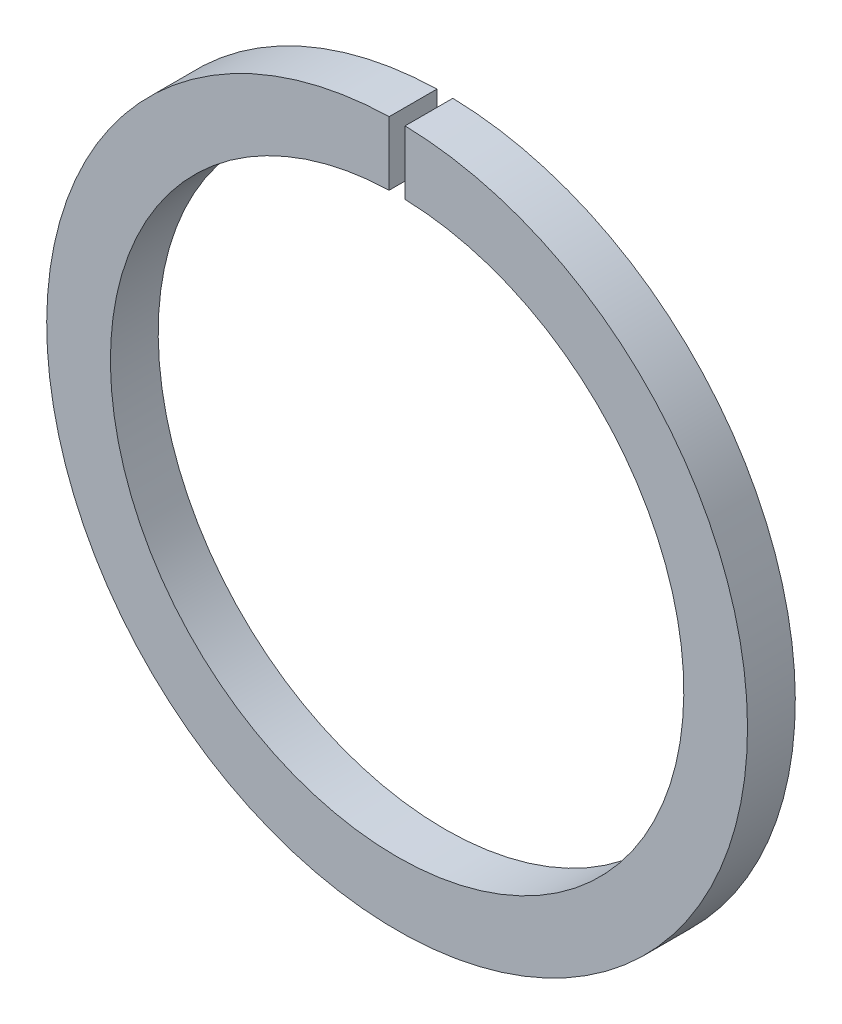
ISO-10303-21;
HEADER;
FILE_DESCRIPTION(('STEP AP214'),'2;1');
FILE_NAME('part.step','',(''),(''),'','','');
FILE_SCHEMA(('AUTOMOTIVE_DESIGN { 1 0 10303 214 1 1 1 1 }'));
ENDSEC;
DATA;
#1=APPLICATION_CONTEXT('core data for automotive mechanical design processes');
#2=APPLICATION_PROTOCOL_DEFINITION('international standard','automotive_design',2000,#1);
#3=PRODUCT_CONTEXT('',#1,'mechanical');
#4=PRODUCT('Part','Part','',(#3));
#5=PRODUCT_RELATED_PRODUCT_CATEGORY('part','',(#4));
#6=PRODUCT_DEFINITION_FORMATION('','',#4);
#7=PRODUCT_DEFINITION_CONTEXT('part definition',#1,'design');
#8=PRODUCT_DEFINITION('design','',#6,#7);
#9=PRODUCT_DEFINITION_SHAPE('','',#8);
#10=(LENGTH_UNIT() NAMED_UNIT(*) SI_UNIT(.MILLI.,.METRE.));
#11=(NAMED_UNIT(*) PLANE_ANGLE_UNIT() SI_UNIT($,.RADIAN.));
#12=(NAMED_UNIT(*) SI_UNIT($,.STERADIAN.) SOLID_ANGLE_UNIT());
#13=UNCERTAINTY_MEASURE_WITH_UNIT(LENGTH_MEASURE(1.E-05),#10,'distance_accuracy_value','');
#14=(GEOMETRIC_REPRESENTATION_CONTEXT(3) GLOBAL_UNCERTAINTY_ASSIGNED_CONTEXT((#13)) GLOBAL_UNIT_ASSIGNED_CONTEXT((#10,
#11,#12)) REPRESENTATION_CONTEXT('',''));
#15=CARTESIAN_POINT('',(0.,0.,0.));
#16=DIRECTION('',(0.,0.,1.));
#17=DIRECTION('',(1.,0.,0.));
#18=AXIS2_PLACEMENT_3D('',#15,#16,#17);
#19=CARTESIAN_POINT('',(0.,0.,1.5));
#20=DIRECTION('',(0.,0.,-1.));
#21=DIRECTION('',(-1.,0.,0.));
#22=AXIS2_PLACEMENT_3D('',#19,#20,#21);
#23=CYLINDRICAL_SURFACE('',#22,11.);
#24=CARTESIAN_POINT('',(0.,0.,0.));
#25=DIRECTION('',(0.,0.,1.));
#26=DIRECTION('',(1.,0.,0.));
#27=AXIS2_PLACEMENT_3D('',#24,#25,#26);
#28=CIRCLE('',#27,11.);
#29=CARTESIAN_POINT('',(-0.25,10.9971587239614,0.));
#30=VERTEX_POINT('',#29);
#31=CARTESIAN_POINT('',(0.25,10.9971587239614,0.));
#32=VERTEX_POINT('',#31);
#33=EDGE_CURVE('E76',#30,#32,#28,.T.);
#34=ORIENTED_EDGE('',*,*,#33,.T.);
#35=DIRECTION('',(0.,0.,-1.));
#36=VECTOR('',#35,1.);
#37=CARTESIAN_POINT('',(0.25,10.9971587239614,1.5));
#38=LINE('',#37,#36);
#39=CARTESIAN_POINT('',(0.25,10.9971587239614,1.5));
#40=VERTEX_POINT('',#39);
#41=EDGE_CURVE('E11',#40,#32,#38,.T.);
#42=ORIENTED_EDGE('',*,*,#41,.F.);
#43=CARTESIAN_POINT('',(0.,0.,1.5));
#44=DIRECTION('',(0.,0.,1.));
#45=DIRECTION('',(1.,0.,0.));
#46=AXIS2_PLACEMENT_3D('',#43,#44,#45);
#47=CIRCLE('',#46,11.);
#48=CARTESIAN_POINT('',(-0.25,10.9971587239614,1.5));
#49=VERTEX_POINT('',#48);
#50=EDGE_CURVE('E94',#49,#40,#47,.T.);
#51=ORIENTED_EDGE('',*,*,#50,.F.);
#52=DIRECTION('',(0.,0.,-1.));
#53=VECTOR('',#52,1.);
#54=CARTESIAN_POINT('',(-0.25,10.9971587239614,1.5));
#55=LINE('',#54,#53);
#56=EDGE_CURVE('E88',#49,#30,#55,.T.);
#57=ORIENTED_EDGE('',*,*,#56,.T.);
#58=EDGE_LOOP('',(#34,#42,#51,#57));
#59=FACE_BOUND('',#58,.T.);
#60=ADVANCED_FACE('F32',(#59),#23,.T.);
#61=CARTESIAN_POINT('',(0.25,8.99652710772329,1.5));
#62=DIRECTION('',(1.,0.,0.));
#63=DIRECTION('',(0.,0.,-1.));
#64=AXIS2_PLACEMENT_3D('',#61,#62,#63);
#65=PLANE('',#64);
#66=DIRECTION('',(0.,-1.,0.));
#67=VECTOR('',#66,1.);
#68=CARTESIAN_POINT('',(0.25,8.99652710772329,0.));
#69=LINE('',#68,#67);
#70=CARTESIAN_POINT('',(0.249999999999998,8.99652710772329,0.));
#71=VERTEX_POINT('',#70);
#72=EDGE_CURVE('E72',#32,#71,#69,.T.);
#73=ORIENTED_EDGE('',*,*,#72,.T.);
#74=DIRECTION('',(0.,0.,-1.));
#75=VECTOR('',#74,1.);
#76=CARTESIAN_POINT('',(0.249999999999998,8.99652710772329,1.5));
#77=LINE('',#76,#75);
#78=CARTESIAN_POINT('',(0.249999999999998,8.99652710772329,1.5));
#79=VERTEX_POINT('',#78);
#80=EDGE_CURVE('E39',#79,#71,#77,.T.);
#81=ORIENTED_EDGE('',*,*,#80,.F.);
#82=DIRECTION('',(0.,-1.,0.));
#83=VECTOR('',#82,1.);
#84=CARTESIAN_POINT('',(0.25,8.99652710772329,1.5));
#85=LINE('',#84,#83);
#86=EDGE_CURVE('E84',#40,#79,#85,.T.);
#87=ORIENTED_EDGE('',*,*,#86,.F.);
#88=ORIENTED_EDGE('',*,*,#41,.T.);
#89=EDGE_LOOP('',(#73,#81,#87,#88));
#90=FACE_BOUND('',#89,.T.);
#91=ADVANCED_FACE('F83',(#90),#65,.F.);
#92=CARTESIAN_POINT('',(0.,0.,1.5));
#93=DIRECTION('',(0.,0.,-1.));
#94=DIRECTION('',(-1.,0.,0.));
#95=AXIS2_PLACEMENT_3D('',#92,#93,#94);
#96=CYLINDRICAL_SURFACE('',#95,9.);
#97=CARTESIAN_POINT('',(0.,0.,0.));
#98=DIRECTION('',(0.,0.,-1.));
#99=DIRECTION('',(1.,0.,0.));
#100=AXIS2_PLACEMENT_3D('',#97,#98,#99);
#101=CIRCLE('',#100,9.);
#102=CARTESIAN_POINT('',(-0.25,8.99652710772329,0.));
#103=VERTEX_POINT('',#102);
#104=EDGE_CURVE('E77',#71,#103,#101,.T.);
#105=ORIENTED_EDGE('',*,*,#104,.T.);
#106=DIRECTION('',(0.,0.,-1.));
#107=VECTOR('',#106,1.);
#108=CARTESIAN_POINT('',(-0.25,8.99652710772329,1.5));
#109=LINE('',#108,#107);
#110=CARTESIAN_POINT('',(-0.25,8.99652710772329,1.5));
#111=VERTEX_POINT('',#110);
#112=EDGE_CURVE('E100',#111,#103,#109,.T.);
#113=ORIENTED_EDGE('',*,*,#112,.F.);
#114=CARTESIAN_POINT('',(0.,0.,1.5));
#115=DIRECTION('',(0.,0.,-1.));
#116=DIRECTION('',(1.,0.,0.));
#117=AXIS2_PLACEMENT_3D('',#114,#115,#116);
#118=CIRCLE('',#117,9.);
#119=EDGE_CURVE('E51',#79,#111,#118,.T.);
#120=ORIENTED_EDGE('',*,*,#119,.F.);
#121=ORIENTED_EDGE('',*,*,#80,.T.);
#122=EDGE_LOOP('',(#105,#113,#120,#121));
#123=FACE_BOUND('',#122,.T.);
#124=ADVANCED_FACE('F103',(#123),#96,.F.);
#125=CARTESIAN_POINT('',(-0.25,8.99652710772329,1.5));
#126=DIRECTION('',(-1.,0.,0.));
#127=DIRECTION('',(0.,0.,1.));
#128=AXIS2_PLACEMENT_3D('',#125,#126,#127);
#129=PLANE('',#128);
#130=DIRECTION('',(0.,1.,0.));
#131=VECTOR('',#130,1.);
#132=CARTESIAN_POINT('',(-0.25,8.99652710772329,0.));
#133=LINE('',#132,#131);
#134=EDGE_CURVE('E92',#103,#30,#133,.T.);
#135=ORIENTED_EDGE('',*,*,#134,.T.);
#136=ORIENTED_EDGE('',*,*,#56,.F.);
#137=DIRECTION('',(0.,1.,0.));
#138=VECTOR('',#137,1.);
#139=CARTESIAN_POINT('',(-0.25,8.99652710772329,1.5));
#140=LINE('',#139,#138);
#141=EDGE_CURVE('E46',#111,#49,#140,.T.);
#142=ORIENTED_EDGE('',*,*,#141,.F.);
#143=ORIENTED_EDGE('',*,*,#112,.T.);
#144=EDGE_LOOP('',(#135,#136,#142,#143));
#145=FACE_BOUND('',#144,.T.);
#146=ADVANCED_FACE('F105',(#145),#129,.F.);
#147=CARTESIAN_POINT('',(0.,0.,1.5));
#148=DIRECTION('',(0.,0.,1.));
#149=DIRECTION('',(1.,0.,0.));
#150=AXIS2_PLACEMENT_3D('',#147,#148,#149);
#151=PLANE('',#150);
#152=ORIENTED_EDGE('',*,*,#50,.T.);
#153=ORIENTED_EDGE('',*,*,#86,.T.);
#154=ORIENTED_EDGE('',*,*,#119,.T.);
#155=ORIENTED_EDGE('',*,*,#141,.T.);
#156=EDGE_LOOP('',(#152,#153,#154,#155));
#157=FACE_BOUND('',#156,.T.);
#158=ADVANCED_FACE('F106',(#157),#151,.T.);
#159=CARTESIAN_POINT('',(0.,0.,0.));
#160=DIRECTION('',(0.,0.,1.));
#161=DIRECTION('',(1.,0.,0.));
#162=AXIS2_PLACEMENT_3D('',#159,#160,#161);
#163=PLANE('',#162);
#164=ORIENTED_EDGE('',*,*,#33,.F.);
#165=ORIENTED_EDGE('',*,*,#134,.F.);
#166=ORIENTED_EDGE('',*,*,#104,.F.);
#167=ORIENTED_EDGE('',*,*,#72,.F.);
#168=EDGE_LOOP('',(#164,#165,#166,#167));
#169=FACE_BOUND('',#168,.T.);
#170=ADVANCED_FACE('F73',(#169),#163,.F.);
#171=CLOSED_SHELL('',(#60,#91,#124,#146,#158,#170));
#172=MANIFOLD_SOLID_BREP('B2',#171);
#173=ADVANCED_BREP_SHAPE_REPRESENTATION('',(#18,#172),#14);
#174=SHAPE_DEFINITION_REPRESENTATION(#9,#173);
ENDSEC;
END-ISO-10303-21;
